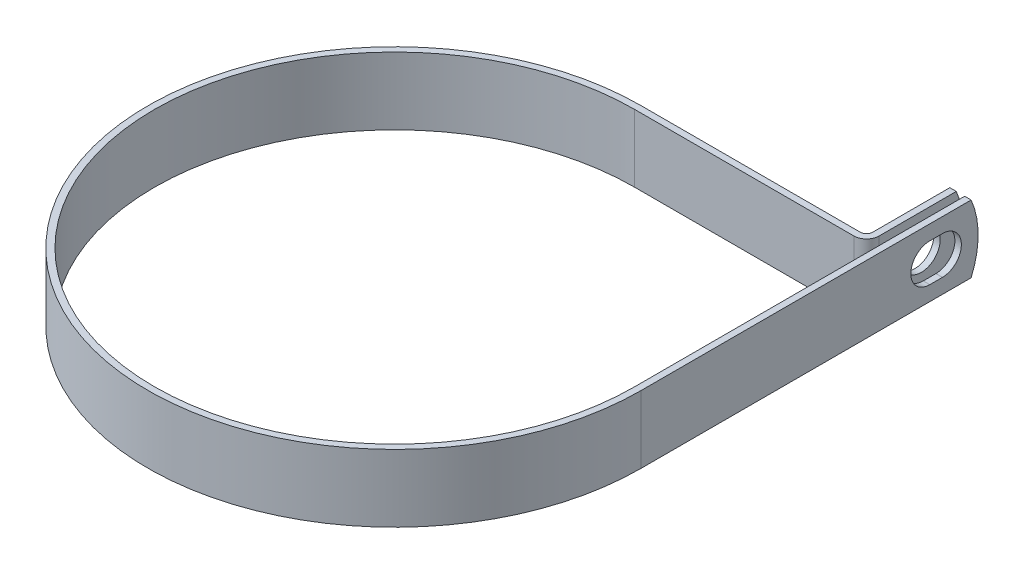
ISO-10303-21;
HEADER;
FILE_DESCRIPTION(('STEP AP214'),'2;1');
FILE_NAME('part.step','',(''),(''),'','','');
FILE_SCHEMA(('AUTOMOTIVE_DESIGN { 1 0 10303 214 1 1 1 1 }'));
ENDSEC;
DATA;
#1=APPLICATION_CONTEXT('core data for automotive mechanical design processes');
#2=APPLICATION_PROTOCOL_DEFINITION('international standard','automotive_design',2000,#1);
#3=PRODUCT_CONTEXT('',#1,'mechanical');
#4=PRODUCT('Part','Part','',(#3));
#5=PRODUCT_RELATED_PRODUCT_CATEGORY('part','',(#4));
#6=PRODUCT_DEFINITION_FORMATION('','',#4);
#7=PRODUCT_DEFINITION_CONTEXT('part definition',#1,'design');
#8=PRODUCT_DEFINITION('design','',#6,#7);
#9=PRODUCT_DEFINITION_SHAPE('','',#8);
#10=(LENGTH_UNIT() NAMED_UNIT(*) SI_UNIT(.MILLI.,.METRE.));
#11=(NAMED_UNIT(*) PLANE_ANGLE_UNIT() SI_UNIT($,.RADIAN.));
#12=(NAMED_UNIT(*) SI_UNIT($,.STERADIAN.) SOLID_ANGLE_UNIT());
#13=UNCERTAINTY_MEASURE_WITH_UNIT(LENGTH_MEASURE(1.E-05),#10,'distance_accuracy_value','');
#14=(GEOMETRIC_REPRESENTATION_CONTEXT(3) GLOBAL_UNCERTAINTY_ASSIGNED_CONTEXT((#13)) GLOBAL_UNIT_ASSIGNED_CONTEXT((#10,
#11,#12)) REPRESENTATION_CONTEXT('',''));
#15=CARTESIAN_POINT('',(0.,0.,0.));
#16=DIRECTION('',(0.,0.,1.));
#17=DIRECTION('',(1.,0.,0.));
#18=AXIS2_PLACEMENT_3D('',#15,#16,#17);
#19=CARTESIAN_POINT('',(45.2374,6.35,0.));
#20=DIRECTION('',(-1.,0.,0.));
#21=DIRECTION('',(0.,0.,1.));
#22=AXIS2_PLACEMENT_3D('',#19,#20,#21);
#23=PLANE('',#22);
#24=DIRECTION('',(0.,0.,-1.));
#25=VECTOR('',#24,1.);
#26=CARTESIAN_POINT('',(45.2374,-3.5687,-54.3559999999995));
#27=LINE('',#26,#25);
#28=CARTESIAN_POINT('',(45.2374,-3.5687,-54.3559999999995));
#29=VERTEX_POINT('',#28);
#30=CARTESIAN_POINT('',(45.2374,-3.5687,-56.7436000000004));
#31=VERTEX_POINT('',#30);
#32=EDGE_CURVE('E236',#29,#31,#27,.T.);
#33=ORIENTED_EDGE('',*,*,#32,.T.);
#34=CARTESIAN_POINT('',(45.2374,0.,-56.7435999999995));
#35=DIRECTION('',(-1.,0.,0.));
#36=DIRECTION('',(0.,0.,1.));
#37=AXIS2_PLACEMENT_3D('',#34,#35,#36);
#38=CIRCLE('',#37,3.5687);
#39=CARTESIAN_POINT('',(45.2374,3.5687,-56.7436000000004));
#40=VERTEX_POINT('',#39);
#41=EDGE_CURVE('E257',#31,#40,#38,.F.);
#42=ORIENTED_EDGE('',*,*,#41,.T.);
#43=DIRECTION('',(0.,0.,1.));
#44=VECTOR('',#43,1.);
#45=CARTESIAN_POINT('',(45.2374,3.5687,-54.3559999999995));
#46=LINE('',#45,#44);
#47=CARTESIAN_POINT('',(45.2374,3.5687,-54.3559999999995));
#48=VERTEX_POINT('',#47);
#49=EDGE_CURVE('E253',#40,#48,#46,.T.);
#50=ORIENTED_EDGE('',*,*,#49,.T.);
#51=CARTESIAN_POINT('',(45.2374,0.,-54.3559999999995));
#52=DIRECTION('',(-1.,0.,0.));
#53=DIRECTION('',(0.,0.,1.));
#54=AXIS2_PLACEMENT_3D('',#51,#52,#53);
#55=CIRCLE('',#54,3.5687);
#56=EDGE_CURVE('E248',#48,#29,#55,.F.);
#57=ORIENTED_EDGE('',*,*,#56,.T.);
#58=EDGE_LOOP('',(#33,#42,#50,#57));
#59=FACE_BOUND('',#58,.T.);
#60=CARTESIAN_POINT('',(45.2374,0.,-47.5996));
#61=DIRECTION('',(-1.,0.,0.));
#62=DIRECTION('',(0.,0.,1.));
#63=AXIS2_PLACEMENT_3D('',#60,#61,#62);
#64=CIRCLE('',#63,15.875);
#65=CARTESIAN_POINT('',(45.2374,6.35,-62.1492778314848));
#66=VERTEX_POINT('',#65);
#67=CARTESIAN_POINT('',(45.2374,-6.35,-62.1492778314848));
#68=VERTEX_POINT('',#67);
#69=EDGE_CURVE('E75',#66,#68,#64,.T.);
#70=ORIENTED_EDGE('',*,*,#69,.T.);
#71=DIRECTION('',(0.,0.,-1.));
#72=VECTOR('',#71,1.);
#73=CARTESIAN_POINT('',(45.2374,-6.35,0.));
#74=LINE('',#73,#72);
#75=CARTESIAN_POINT('',(45.2374,-6.35,0.));
#76=VERTEX_POINT('',#75);
#77=EDGE_CURVE('E271',#76,#68,#74,.T.);
#78=ORIENTED_EDGE('',*,*,#77,.F.);
#79=DIRECTION('',(0.,-1.,0.));
#80=VECTOR('',#79,1.);
#81=CARTESIAN_POINT('',(45.2374,6.35,0.));
#82=LINE('',#81,#80);
#83=CARTESIAN_POINT('',(45.2374,6.35,0.));
#84=VERTEX_POINT('',#83);
#85=EDGE_CURVE('E218',#84,#76,#82,.T.);
#86=ORIENTED_EDGE('',*,*,#85,.F.);
#87=DIRECTION('',(0.,0.,-1.));
#88=VECTOR('',#87,1.);
#89=CARTESIAN_POINT('',(45.2374,6.35,-45.2374));
#90=LINE('',#89,#88);
#91=EDGE_CURVE('E273',#84,#66,#90,.T.);
#92=ORIENTED_EDGE('',*,*,#91,.T.);
#93=EDGE_LOOP('',(#70,#78,#86,#92));
#94=FACE_BOUND('',#93,.T.);
#95=ADVANCED_FACE('F54',(#59,#94),#23,.T.);
#96=CARTESIAN_POINT('',(43.6626,6.35,-63.4746));
#97=DIRECTION('',(1.,0.,0.));
#98=DIRECTION('',(0.,0.,-1.));
#99=AXIS2_PLACEMENT_3D('',#96,#97,#98);
#100=PLANE('',#99);
#101=CARTESIAN_POINT('',(43.6626,0.,-55.5498));
#102=DIRECTION('',(1.,0.,0.));
#103=DIRECTION('',(0.,0.,-1.));
#104=AXIS2_PLACEMENT_3D('',#101,#102,#103);
#105=CIRCLE('',#104,3.5687);
#106=CARTESIAN_POINT('',(43.6626,0.,-59.1185));
#107=VERTEX_POINT('',#106);
#108=EDGE_CURVE('E268',#107,#107,#105,.F.);
#109=ORIENTED_EDGE('',*,*,#108,.T.);
#110=EDGE_LOOP('',(#109));
#111=FACE_BOUND('',#110,.T.);
#112=DIRECTION('',(0.,0.,1.));
#113=VECTOR('',#112,1.);
#114=CARTESIAN_POINT('',(43.6626,-6.35,-63.4746));
#115=LINE('',#114,#113);
#116=CARTESIAN_POINT('',(43.6626,-6.35,-62.1492778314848));
#117=VERTEX_POINT('',#116);
#118=CARTESIAN_POINT('',(43.6626,-6.35,-47.61484));
#119=VERTEX_POINT('',#118);
#120=EDGE_CURVE('E184',#117,#119,#115,.T.);
#121=ORIENTED_EDGE('',*,*,#120,.F.);
#122=CARTESIAN_POINT('',(43.6626,0.,-47.5996));
#123=DIRECTION('',(1.,0.,0.));
#124=DIRECTION('',(0.,0.,-1.));
#125=AXIS2_PLACEMENT_3D('',#122,#123,#124);
#126=CIRCLE('',#125,15.875);
#127=CARTESIAN_POINT('',(43.6626,6.35,-62.1492778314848));
#128=VERTEX_POINT('',#127);
#129=EDGE_CURVE('E176',#117,#128,#126,.T.);
#130=ORIENTED_EDGE('',*,*,#129,.T.);
#131=DIRECTION('',(0.,0.,1.));
#132=VECTOR('',#131,1.);
#133=CARTESIAN_POINT('',(43.6626,6.35,-63.4746));
#134=LINE('',#133,#132);
#135=CARTESIAN_POINT('',(43.6626,6.35,-47.61484));
#136=VERTEX_POINT('',#135);
#137=EDGE_CURVE('E224',#128,#136,#134,.T.);
#138=ORIENTED_EDGE('',*,*,#137,.T.);
#139=DIRECTION('',(0.,-1.,0.));
#140=VECTOR('',#139,1.);
#141=CARTESIAN_POINT('',(43.6626,6.35,-47.61484));
#142=LINE('',#141,#140);
#143=EDGE_CURVE('E211',#136,#119,#142,.T.);
#144=ORIENTED_EDGE('',*,*,#143,.T.);
#145=EDGE_LOOP('',(#121,#130,#138,#144));
#146=FACE_BOUND('',#145,.T.);
#147=ADVANCED_FACE('F226',(#111,#146),#100,.T.);
#148=CARTESIAN_POINT('',(42.4434,6.35,-63.4746));
#149=DIRECTION('',(1.,0.,0.));
#150=DIRECTION('',(0.,0.,-1.));
#151=AXIS2_PLACEMENT_3D('',#148,#149,#150);
#152=PLANE('',#151);
#153=CARTESIAN_POINT('',(42.4434,0.,-55.5498));
#154=DIRECTION('',(-1.,0.,0.));
#155=DIRECTION('',(0.,0.,1.));
#156=AXIS2_PLACEMENT_3D('',#153,#154,#155);
#157=CIRCLE('',#156,3.5687);
#158=CARTESIAN_POINT('',(42.4434,0.,-51.9811));
#159=VERTEX_POINT('',#158);
#160=EDGE_CURVE('E265',#159,#159,#157,.T.);
#161=ORIENTED_EDGE('',*,*,#160,.F.);
#162=EDGE_LOOP('',(#161));
#163=FACE_BOUND('',#162,.T.);
#164=CARTESIAN_POINT('',(42.4434,0.,-47.5996));
#165=DIRECTION('',(-1.,0.,0.));
#166=DIRECTION('',(0.,0.,1.));
#167=AXIS2_PLACEMENT_3D('',#164,#165,#166);
#168=CIRCLE('',#167,15.875);
#169=CARTESIAN_POINT('',(42.4434,6.35,-62.1492778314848));
#170=VERTEX_POINT('',#169);
#171=CARTESIAN_POINT('',(42.4434,-6.35,-62.1492778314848));
#172=VERTEX_POINT('',#171);
#173=EDGE_CURVE('E67',#170,#172,#168,.T.);
#174=ORIENTED_EDGE('',*,*,#173,.T.);
#175=DIRECTION('',(0.,0.,1.));
#176=VECTOR('',#175,1.);
#177=CARTESIAN_POINT('',(42.4434,-6.35,-63.4746));
#178=LINE('',#177,#176);
#179=CARTESIAN_POINT('',(42.4434,-6.35,-47.61484));
#180=VERTEX_POINT('',#179);
#181=EDGE_CURVE('E167',#172,#180,#178,.T.);
#182=ORIENTED_EDGE('',*,*,#181,.T.);
#183=DIRECTION('',(0.,-1.,0.));
#184=VECTOR('',#183,1.);
#185=CARTESIAN_POINT('',(42.4434,6.35,-47.61484));
#186=LINE('',#185,#184);
#187=CARTESIAN_POINT('',(42.4434,6.35,-47.61484));
#188=VERTEX_POINT('',#187);
#189=EDGE_CURVE('E209',#188,#180,#186,.T.);
#190=ORIENTED_EDGE('',*,*,#189,.F.);
#191=DIRECTION('',(0.,0.,1.));
#192=VECTOR('',#191,1.);
#193=CARTESIAN_POINT('',(42.4434,6.35,-63.4746));
#194=LINE('',#193,#192);
#195=EDGE_CURVE('E169',#170,#188,#194,.T.);
#196=ORIENTED_EDGE('',*,*,#195,.F.);
#197=EDGE_LOOP('',(#174,#182,#190,#196));
#198=FACE_BOUND('',#197,.T.);
#199=ADVANCED_FACE('F164',(#163,#198),#152,.F.);
#200=CARTESIAN_POINT('',(46.4566,6.35,0.));
#201=DIRECTION('',(-1.,0.,0.));
#202=DIRECTION('',(0.,0.,1.));
#203=AXIS2_PLACEMENT_3D('',#200,#201,#202);
#204=PLANE('',#203);
#205=CARTESIAN_POINT('',(46.4566,0.,-56.7435999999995));
#206=DIRECTION('',(1.,0.,0.));
#207=DIRECTION('',(0.,0.,-1.));
#208=AXIS2_PLACEMENT_3D('',#205,#206,#207);
#209=CIRCLE('',#208,3.5687);
#210=CARTESIAN_POINT('',(46.4566,-3.5687,-56.7436000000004));
#211=VERTEX_POINT('',#210);
#212=CARTESIAN_POINT('',(46.4566,3.5687,-56.7436000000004));
#213=VERTEX_POINT('',#212);
#214=EDGE_CURVE('E237',#211,#213,#209,.T.);
#215=ORIENTED_EDGE('',*,*,#214,.F.);
#216=DIRECTION('',(0.,0.,-1.));
#217=VECTOR('',#216,1.);
#218=CARTESIAN_POINT('',(46.4566,-3.5687,-54.3559999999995));
#219=LINE('',#218,#217);
#220=CARTESIAN_POINT('',(46.4566,-3.5687,-54.3559999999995));
#221=VERTEX_POINT('',#220);
#222=EDGE_CURVE('E240',#221,#211,#219,.T.);
#223=ORIENTED_EDGE('',*,*,#222,.F.);
#224=CARTESIAN_POINT('',(46.4566,0.,-54.3559999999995));
#225=DIRECTION('',(1.,0.,0.));
#226=DIRECTION('',(0.,0.,-1.));
#227=AXIS2_PLACEMENT_3D('',#224,#225,#226);
#228=CIRCLE('',#227,3.5687);
#229=CARTESIAN_POINT('',(46.4566,3.5687,-54.3559999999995));
#230=VERTEX_POINT('',#229);
#231=EDGE_CURVE('E230',#230,#221,#228,.T.);
#232=ORIENTED_EDGE('',*,*,#231,.F.);
#233=DIRECTION('',(0.,0.,1.));
#234=VECTOR('',#233,1.);
#235=CARTESIAN_POINT('',(46.4566,3.5687,-54.3559999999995));
#236=LINE('',#235,#234);
#237=EDGE_CURVE('E234',#213,#230,#236,.T.);
#238=ORIENTED_EDGE('',*,*,#237,.F.);
#239=EDGE_LOOP('',(#215,#223,#232,#238));
#240=FACE_BOUND('',#239,.T.);
#241=DIRECTION('',(0.,0.,-1.));
#242=VECTOR('',#241,1.);
#243=CARTESIAN_POINT('',(46.4566,-6.35,0.));
#244=LINE('',#243,#242);
#245=CARTESIAN_POINT('',(46.4566,-6.35,0.));
#246=VERTEX_POINT('',#245);
#247=CARTESIAN_POINT('',(46.4566,-6.35,-62.1492778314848));
#248=VERTEX_POINT('',#247);
#249=EDGE_CURVE('E195',#246,#248,#244,.T.);
#250=ORIENTED_EDGE('',*,*,#249,.T.);
#251=CARTESIAN_POINT('',(46.4566,0.,-47.5996));
#252=DIRECTION('',(-1.,0.,0.));
#253=DIRECTION('',(0.,0.,1.));
#254=AXIS2_PLACEMENT_3D('',#251,#252,#253);
#255=CIRCLE('',#254,15.875);
#256=CARTESIAN_POINT('',(46.4566,6.35,-62.1492778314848));
#257=VERTEX_POINT('',#256);
#258=EDGE_CURVE('E170',#257,#248,#255,.T.);
#259=ORIENTED_EDGE('',*,*,#258,.F.);
#260=DIRECTION('',(0.,0.,-1.));
#261=VECTOR('',#260,1.);
#262=CARTESIAN_POINT('',(46.4566,6.35,-45.2374));
#263=LINE('',#262,#261);
#264=CARTESIAN_POINT('',(46.4566,6.35,0.));
#265=VERTEX_POINT('',#264);
#266=EDGE_CURVE('E198',#265,#257,#263,.T.);
#267=ORIENTED_EDGE('',*,*,#266,.F.);
#268=DIRECTION('',(0.,-1.,0.));
#269=VECTOR('',#268,1.);
#270=CARTESIAN_POINT('',(46.4566,6.35,0.));
#271=LINE('',#270,#269);
#272=EDGE_CURVE('E199',#265,#246,#271,.T.);
#273=ORIENTED_EDGE('',*,*,#272,.T.);
#274=EDGE_LOOP('',(#250,#259,#267,#273));
#275=FACE_BOUND('',#274,.T.);
#276=ADVANCED_FACE('F321',(#240,#275),#204,.F.);
#277=CARTESIAN_POINT('',(0.,-6.35,0.));
#278=DIRECTION('',(0.,1.,0.));
#279=DIRECTION('',(1.,0.,0.));
#280=AXIS2_PLACEMENT_3D('',#277,#278,#279);
#281=PLANE('',#280);
#282=DIRECTION('',(-1.,0.,0.));
#283=VECTOR('',#282,1.);
#284=CARTESIAN_POINT('',(46.4566,-6.35,-62.1492778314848));
#285=LINE('',#284,#283);
#286=EDGE_CURVE('E171',#248,#68,#285,.T.);
#287=ORIENTED_EDGE('',*,*,#286,.F.);
#288=ORIENTED_EDGE('',*,*,#249,.F.);
#289=CARTESIAN_POINT('',(0.,-6.35,0.));
#290=DIRECTION('',(0.,1.,0.));
#291=DIRECTION('',(1.,0.,0.));
#292=AXIS2_PLACEMENT_3D('',#289,#290,#291);
#293=CIRCLE('',#292,46.4566);
#294=CARTESIAN_POINT('',(0.,-6.35,-46.4566));
#295=VERTEX_POINT('',#294);
#296=EDGE_CURVE('E193',#295,#246,#293,.T.);
#297=ORIENTED_EDGE('',*,*,#296,.F.);
#298=DIRECTION('',(1.,0.,0.));
#299=VECTOR('',#298,1.);
#300=CARTESIAN_POINT('',(0.,-6.35,-46.4566));
#301=LINE('',#300,#299);
#302=CARTESIAN_POINT('',(41.28516,-6.35,-46.4566));
#303=VERTEX_POINT('',#302);
#304=EDGE_CURVE('E186',#303,#295,#301,.F.);
#305=ORIENTED_EDGE('',*,*,#304,.F.);
#306=CARTESIAN_POINT('',(41.28516,-6.35,-47.61484));
#307=DIRECTION('',(0.,1.,0.));
#308=DIRECTION('',(1.,0.,0.));
#309=AXIS2_PLACEMENT_3D('',#306,#307,#308);
#310=CIRCLE('',#309,1.15824000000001);
#311=EDGE_CURVE('E183',#180,#303,#310,.F.);
#312=ORIENTED_EDGE('',*,*,#311,.F.);
#313=ORIENTED_EDGE('',*,*,#181,.F.);
#314=DIRECTION('',(-1.,0.,0.));
#315=VECTOR('',#314,1.);
#316=CARTESIAN_POINT('',(46.4566,-6.35,-62.1492778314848));
#317=LINE('',#316,#315);
#318=EDGE_CURVE('E12',#117,#172,#317,.T.);
#319=ORIENTED_EDGE('',*,*,#318,.F.);
#320=ORIENTED_EDGE('',*,*,#120,.T.);
#321=CARTESIAN_POINT('',(41.28516,-6.35,-47.61484));
#322=DIRECTION('',(0.,-1.,0.));
#323=DIRECTION('',(0.,0.,1.));
#324=AXIS2_PLACEMENT_3D('',#321,#322,#323);
#325=CIRCLE('',#324,2.37744);
#326=CARTESIAN_POINT('',(41.28516,-6.35,-45.2374));
#327=VERTEX_POINT('',#326);
#328=EDGE_CURVE('E188',#119,#327,#325,.T.);
#329=ORIENTED_EDGE('',*,*,#328,.T.);
#330=DIRECTION('',(-1.,0.,0.));
#331=VECTOR('',#330,1.);
#332=CARTESIAN_POINT('',(0.,-6.35,-45.2374));
#333=LINE('',#332,#331);
#334=CARTESIAN_POINT('',(0.,-6.35,-45.2374));
#335=VERTEX_POINT('',#334);
#336=EDGE_CURVE('E298',#327,#335,#333,.T.);
#337=ORIENTED_EDGE('',*,*,#336,.T.);
#338=CARTESIAN_POINT('',(0.,-6.35,0.));
#339=DIRECTION('',(0.,1.,0.));
#340=DIRECTION('',(0.,0.,1.));
#341=AXIS2_PLACEMENT_3D('',#338,#339,#340);
#342=CIRCLE('',#341,45.2374);
#343=EDGE_CURVE('E295',#335,#76,#342,.T.);
#344=ORIENTED_EDGE('',*,*,#343,.T.);
#345=ORIENTED_EDGE('',*,*,#77,.T.);
#346=EDGE_LOOP('',(#287,#288,#297,#305,#312,#313,#319,#320,#329,#337,#344,#345));
#347=FACE_BOUND('',#346,.T.);
#348=ADVANCED_FACE('F181',(#347),#281,.F.);
#349=CARTESIAN_POINT('',(0.,6.35,0.));
#350=DIRECTION('',(0.,1.,0.));
#351=DIRECTION('',(1.,0.,0.));
#352=AXIS2_PLACEMENT_3D('',#349,#350,#351);
#353=PLANE('',#352);
#354=ORIENTED_EDGE('',*,*,#266,.T.);
#355=DIRECTION('',(-1.,0.,0.));
#356=VECTOR('',#355,1.);
#357=CARTESIAN_POINT('',(46.4566,6.35,-62.1492778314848));
#358=LINE('',#357,#356);
#359=EDGE_CURVE('E228',#257,#66,#358,.T.);
#360=ORIENTED_EDGE('',*,*,#359,.T.);
#361=ORIENTED_EDGE('',*,*,#91,.F.);
#362=CARTESIAN_POINT('',(0.,6.35,0.));
#363=DIRECTION('',(0.,1.,0.));
#364=DIRECTION('',(0.,0.,1.));
#365=AXIS2_PLACEMENT_3D('',#362,#363,#364);
#366=CIRCLE('',#365,45.2374);
#367=CARTESIAN_POINT('',(0.,6.35,-45.2374));
#368=VERTEX_POINT('',#367);
#369=EDGE_CURVE('E276',#368,#84,#366,.T.);
#370=ORIENTED_EDGE('',*,*,#369,.F.);
#371=DIRECTION('',(-1.,0.,0.));
#372=VECTOR('',#371,1.);
#373=CARTESIAN_POINT('',(0.,6.35,-45.2374));
#374=LINE('',#373,#372);
#375=CARTESIAN_POINT('',(41.28516,6.35,-45.2374));
#376=VERTEX_POINT('',#375);
#377=EDGE_CURVE('E279',#376,#368,#374,.T.);
#378=ORIENTED_EDGE('',*,*,#377,.F.);
#379=CARTESIAN_POINT('',(41.28516,6.35,-47.61484));
#380=DIRECTION('',(0.,-1.,0.));
#381=DIRECTION('',(0.,0.,1.));
#382=AXIS2_PLACEMENT_3D('',#379,#380,#381);
#383=CIRCLE('',#382,2.37744);
#384=EDGE_CURVE('E282',#136,#376,#383,.T.);
#385=ORIENTED_EDGE('',*,*,#384,.F.);
#386=ORIENTED_EDGE('',*,*,#137,.F.);
#387=DIRECTION('',(-1.,0.,0.));
#388=VECTOR('',#387,1.);
#389=CARTESIAN_POINT('',(46.4566,6.35,-62.1492778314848));
#390=LINE('',#389,#388);
#391=EDGE_CURVE('E61',#128,#170,#390,.T.);
#392=ORIENTED_EDGE('',*,*,#391,.T.);
#393=ORIENTED_EDGE('',*,*,#195,.T.);
#394=CARTESIAN_POINT('',(41.28516,6.35,-47.61484));
#395=DIRECTION('',(0.,1.,0.));
#396=DIRECTION('',(1.,0.,0.));
#397=AXIS2_PLACEMENT_3D('',#394,#395,#396);
#398=CIRCLE('',#397,1.15824000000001);
#399=CARTESIAN_POINT('',(41.28516,6.35,-46.4566));
#400=VERTEX_POINT('',#399);
#401=EDGE_CURVE('E287',#188,#400,#398,.F.);
#402=ORIENTED_EDGE('',*,*,#401,.T.);
#403=DIRECTION('',(1.,0.,0.));
#404=VECTOR('',#403,1.);
#405=CARTESIAN_POINT('',(0.,6.35,-46.4566));
#406=LINE('',#405,#404);
#407=CARTESIAN_POINT('',(0.,6.35,-46.4566));
#408=VERTEX_POINT('',#407);
#409=EDGE_CURVE('E289',#400,#408,#406,.F.);
#410=ORIENTED_EDGE('',*,*,#409,.T.);
#411=CARTESIAN_POINT('',(0.,6.35,0.));
#412=DIRECTION('',(0.,1.,0.));
#413=DIRECTION('',(1.,0.,0.));
#414=AXIS2_PLACEMENT_3D('',#411,#412,#413);
#415=CIRCLE('',#414,46.4566);
#416=EDGE_CURVE('E203',#408,#265,#415,.T.);
#417=ORIENTED_EDGE('',*,*,#416,.T.);
#418=EDGE_LOOP('',(#354,#360,#361,#370,#378,#385,#386,#392,#393,#402,#410,#417));
#419=FACE_BOUND('',#418,.T.);
#420=ADVANCED_FACE('F222',(#419),#353,.T.);
#421=CARTESIAN_POINT('',(0.,6.35,0.));
#422=DIRECTION('',(0.,-1.,0.));
#423=DIRECTION('',(0.,0.,-1.));
#424=AXIS2_PLACEMENT_3D('',#421,#422,#423);
#425=CYLINDRICAL_SURFACE('',#424,45.2374);
#426=ORIENTED_EDGE('',*,*,#343,.F.);
#427=DIRECTION('',(0.,-1.,0.));
#428=VECTOR('',#427,1.);
#429=CARTESIAN_POINT('',(0.,6.35,-45.2374));
#430=LINE('',#429,#428);
#431=EDGE_CURVE('E216',#368,#335,#430,.T.);
#432=ORIENTED_EDGE('',*,*,#431,.F.);
#433=ORIENTED_EDGE('',*,*,#369,.T.);
#434=ORIENTED_EDGE('',*,*,#85,.T.);
#435=EDGE_LOOP('',(#426,#432,#433,#434));
#436=FACE_BOUND('',#435,.T.);
#437=ADVANCED_FACE('F311',(#436),#425,.F.);
#438=CARTESIAN_POINT('',(0.,6.35,-45.2374));
#439=DIRECTION('',(0.,0.,1.));
#440=DIRECTION('',(1.,0.,0.));
#441=AXIS2_PLACEMENT_3D('',#438,#439,#440);
#442=PLANE('',#441);
#443=ORIENTED_EDGE('',*,*,#336,.F.);
#444=DIRECTION('',(0.,-1.,0.));
#445=VECTOR('',#444,1.);
#446=CARTESIAN_POINT('',(41.28516,6.35,-45.2374));
#447=LINE('',#446,#445);
#448=EDGE_CURVE('E214',#376,#327,#447,.T.);
#449=ORIENTED_EDGE('',*,*,#448,.F.);
#450=ORIENTED_EDGE('',*,*,#377,.T.);
#451=ORIENTED_EDGE('',*,*,#431,.T.);
#452=EDGE_LOOP('',(#443,#449,#450,#451));
#453=FACE_BOUND('',#452,.T.);
#454=ADVANCED_FACE('F307',(#453),#442,.T.);
#455=CARTESIAN_POINT('',(41.28516,6.35,-47.61484));
#456=DIRECTION('',(0.,-1.,0.));
#457=DIRECTION('',(0.,0.,-1.));
#458=AXIS2_PLACEMENT_3D('',#455,#456,#457);
#459=CYLINDRICAL_SURFACE('',#458,2.37744);
#460=ORIENTED_EDGE('',*,*,#328,.F.);
#461=ORIENTED_EDGE('',*,*,#143,.F.);
#462=ORIENTED_EDGE('',*,*,#384,.T.);
#463=ORIENTED_EDGE('',*,*,#448,.T.);
#464=EDGE_LOOP('',(#460,#461,#462,#463));
#465=FACE_BOUND('',#464,.T.);
#466=ADVANCED_FACE('F304',(#465),#459,.T.);
#467=CARTESIAN_POINT('',(41.28516,6.35,-47.61484));
#468=DIRECTION('',(0.,-1.,0.));
#469=DIRECTION('',(0.,0.,-1.));
#470=AXIS2_PLACEMENT_3D('',#467,#468,#469);
#471=CYLINDRICAL_SURFACE('',#470,1.15824000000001);
#472=ORIENTED_EDGE('',*,*,#311,.T.);
#473=DIRECTION('',(0.,-1.,0.));
#474=VECTOR('',#473,1.);
#475=CARTESIAN_POINT('',(41.28516,6.35,-46.4566));
#476=LINE('',#475,#474);
#477=EDGE_CURVE('E206',#400,#303,#476,.T.);
#478=ORIENTED_EDGE('',*,*,#477,.F.);
#479=ORIENTED_EDGE('',*,*,#401,.F.);
#480=ORIENTED_EDGE('',*,*,#189,.T.);
#481=EDGE_LOOP('',(#472,#478,#479,#480));
#482=FACE_BOUND('',#481,.T.);
#483=ADVANCED_FACE('F334',(#482),#471,.F.);
#484=CARTESIAN_POINT('',(0.,6.35,-46.4566));
#485=DIRECTION('',(0.,0.,1.));
#486=DIRECTION('',(1.,0.,0.));
#487=AXIS2_PLACEMENT_3D('',#484,#485,#486);
#488=PLANE('',#487);
#489=ORIENTED_EDGE('',*,*,#304,.T.);
#490=DIRECTION('',(0.,-1.,0.));
#491=VECTOR('',#490,1.);
#492=CARTESIAN_POINT('',(0.,6.35,-46.4566));
#493=LINE('',#492,#491);
#494=EDGE_CURVE('E202',#408,#295,#493,.T.);
#495=ORIENTED_EDGE('',*,*,#494,.F.);
#496=ORIENTED_EDGE('',*,*,#409,.F.);
#497=ORIENTED_EDGE('',*,*,#477,.T.);
#498=EDGE_LOOP('',(#489,#495,#496,#497));
#499=FACE_BOUND('',#498,.T.);
#500=ADVANCED_FACE('F330',(#499),#488,.F.);
#501=CARTESIAN_POINT('',(0.,6.35,0.));
#502=DIRECTION('',(0.,-1.,0.));
#503=DIRECTION('',(0.,0.,-1.));
#504=AXIS2_PLACEMENT_3D('',#501,#502,#503);
#505=CYLINDRICAL_SURFACE('',#504,46.4566);
#506=ORIENTED_EDGE('',*,*,#296,.T.);
#507=ORIENTED_EDGE('',*,*,#272,.F.);
#508=ORIENTED_EDGE('',*,*,#416,.F.);
#509=ORIENTED_EDGE('',*,*,#494,.T.);
#510=EDGE_LOOP('',(#506,#507,#508,#509));
#511=FACE_BOUND('',#510,.T.);
#512=ADVANCED_FACE('F327',(#511),#505,.T.);
#513=CARTESIAN_POINT('',(53.7564078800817,0.,-55.5498));
#514=DIRECTION('',(-1.,0.,0.));
#515=DIRECTION('',(0.,0.,1.));
#516=AXIS2_PLACEMENT_3D('',#513,#514,#515);
#517=CYLINDRICAL_SURFACE('',#516,3.5687);
#518=ORIENTED_EDGE('',*,*,#160,.T.);
#519=EDGE_LOOP('',(#518));
#520=FACE_BOUND('',#519,.T.);
#521=ORIENTED_EDGE('',*,*,#108,.F.);
#522=EDGE_LOOP('',(#521));
#523=FACE_BOUND('',#522,.T.);
#524=ADVANCED_FACE('F379',(#520,#523),#517,.F.);
#525=CARTESIAN_POINT('',(33.3349589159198,-3.5687,-54.3559999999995));
#526=DIRECTION('',(0.,-1.,0.));
#527=DIRECTION('',(0.,0.,-1.));
#528=AXIS2_PLACEMENT_3D('',#525,#526,#527);
#529=PLANE('',#528);
#530=DIRECTION('',(1.,0.,0.));
#531=VECTOR('',#530,1.);
#532=CARTESIAN_POINT('',(33.3349589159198,-3.5687,-54.3559999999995));
#533=LINE('',#532,#531);
#534=EDGE_CURVE('E251',#29,#221,#533,.T.);
#535=ORIENTED_EDGE('',*,*,#534,.T.);
#536=ORIENTED_EDGE('',*,*,#222,.T.);
#537=DIRECTION('',(1.,0.,0.));
#538=VECTOR('',#537,1.);
#539=CARTESIAN_POINT('',(33.3349589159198,-3.5687,-56.7436000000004));
#540=LINE('',#539,#538);
#541=EDGE_CURVE('E247',#31,#211,#540,.T.);
#542=ORIENTED_EDGE('',*,*,#541,.F.);
#543=ORIENTED_EDGE('',*,*,#32,.F.);
#544=EDGE_LOOP('',(#535,#536,#542,#543));
#545=FACE_BOUND('',#544,.T.);
#546=ADVANCED_FACE('F354',(#545),#529,.F.);
#547=CARTESIAN_POINT('',(33.3349589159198,0.,-56.7435999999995));
#548=DIRECTION('',(1.,0.,0.));
#549=DIRECTION('',(0.,0.,-1.));
#550=AXIS2_PLACEMENT_3D('',#547,#548,#549);
#551=CYLINDRICAL_SURFACE('',#550,3.5687);
#552=ORIENTED_EDGE('',*,*,#541,.T.);
#553=ORIENTED_EDGE('',*,*,#214,.T.);
#554=DIRECTION('',(1.,0.,0.));
#555=VECTOR('',#554,1.);
#556=CARTESIAN_POINT('',(33.3349589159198,3.5687,-56.7436000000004));
#557=LINE('',#556,#555);
#558=EDGE_CURVE('E256',#40,#213,#557,.T.);
#559=ORIENTED_EDGE('',*,*,#558,.F.);
#560=ORIENTED_EDGE('',*,*,#41,.F.);
#561=EDGE_LOOP('',(#552,#553,#559,#560));
#562=FACE_BOUND('',#561,.T.);
#563=ADVANCED_FACE('F358',(#562),#551,.F.);
#564=CARTESIAN_POINT('',(33.3349589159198,3.5687,-54.3559999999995));
#565=DIRECTION('',(0.,1.,0.));
#566=DIRECTION('',(0.,0.,1.));
#567=AXIS2_PLACEMENT_3D('',#564,#565,#566);
#568=PLANE('',#567);
#569=ORIENTED_EDGE('',*,*,#558,.T.);
#570=ORIENTED_EDGE('',*,*,#237,.T.);
#571=DIRECTION('',(1.,0.,0.));
#572=VECTOR('',#571,1.);
#573=CARTESIAN_POINT('',(33.3349589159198,3.5687,-54.3559999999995));
#574=LINE('',#573,#572);
#575=EDGE_CURVE('E252',#48,#230,#574,.T.);
#576=ORIENTED_EDGE('',*,*,#575,.F.);
#577=ORIENTED_EDGE('',*,*,#49,.F.);
#578=EDGE_LOOP('',(#569,#570,#576,#577));
#579=FACE_BOUND('',#578,.T.);
#580=ADVANCED_FACE('F362',(#579),#568,.F.);
#581=CARTESIAN_POINT('',(33.3349589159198,0.,-54.3559999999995));
#582=DIRECTION('',(1.,0.,0.));
#583=DIRECTION('',(0.,0.,-1.));
#584=AXIS2_PLACEMENT_3D('',#581,#582,#583);
#585=CYLINDRICAL_SURFACE('',#584,3.5687);
#586=ORIENTED_EDGE('',*,*,#575,.T.);
#587=ORIENTED_EDGE('',*,*,#231,.T.);
#588=ORIENTED_EDGE('',*,*,#534,.F.);
#589=ORIENTED_EDGE('',*,*,#56,.F.);
#590=EDGE_LOOP('',(#586,#587,#588,#589));
#591=FACE_BOUND('',#590,.T.);
#592=ADVANCED_FACE('F366',(#591),#585,.F.);
#593=CARTESIAN_POINT('',(46.4566,0.,-47.5996));
#594=DIRECTION('',(-1.,0.,0.));
#595=DIRECTION('',(0.,0.,1.));
#596=AXIS2_PLACEMENT_3D('',#593,#594,#595);
#597=CYLINDRICAL_SURFACE('',#596,15.875);
#598=ORIENTED_EDGE('',*,*,#129,.F.);
#599=ORIENTED_EDGE('',*,*,#318,.T.);
#600=ORIENTED_EDGE('',*,*,#173,.F.);
#601=ORIENTED_EDGE('',*,*,#391,.F.);
#602=EDGE_LOOP('',(#598,#599,#600,#601));
#603=FACE_BOUND('',#602,.T.);
#604=ADVANCED_FACE('F174',(#603),#597,.T.);
#605=ORIENTED_EDGE('',*,*,#359,.F.);
#606=ORIENTED_EDGE('',*,*,#258,.T.);
#607=ORIENTED_EDGE('',*,*,#286,.T.);
#608=ORIENTED_EDGE('',*,*,#69,.F.);
#609=EDGE_LOOP('',(#605,#606,#607,#608));
#610=FACE_BOUND('',#609,.T.);
#611=ADVANCED_FACE('F316',(#610),#597,.T.);
#612=CLOSED_SHELL('',(#95,#147,#199,#276,#348,#420,#437,#454,#466,#483,#500,#512,#524,#546,#563,
#580,#592,#604,#611));
#613=MANIFOLD_SOLID_BREP('B2',#612);
#614=ADVANCED_BREP_SHAPE_REPRESENTATION('',(#18,#613),#14);
#615=SHAPE_DEFINITION_REPRESENTATION(#9,#614);
ENDSEC;
END-ISO-10303-21;
